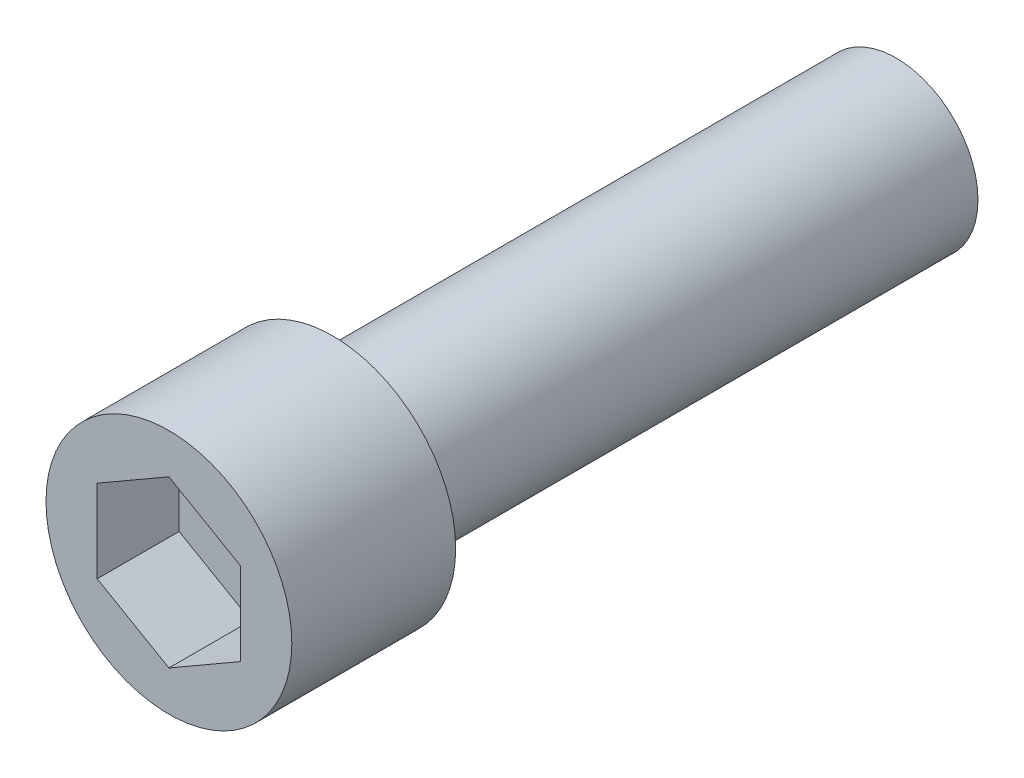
ISO-10303-21;
HEADER;
FILE_DESCRIPTION(('STEP AP214'),'2;1');
FILE_NAME('part.step','',(''),(''),'','','');
FILE_SCHEMA(('AUTOMOTIVE_DESIGN { 1 0 10303 214 1 1 1 1 }'));
ENDSEC;
DATA;
#1=APPLICATION_CONTEXT('core data for automotive mechanical design processes');
#2=APPLICATION_PROTOCOL_DEFINITION('international standard','automotive_design',2000,#1);
#3=PRODUCT_CONTEXT('',#1,'mechanical');
#4=PRODUCT('Part','Part','',(#3));
#5=PRODUCT_RELATED_PRODUCT_CATEGORY('part','',(#4));
#6=PRODUCT_DEFINITION_FORMATION('','',#4);
#7=PRODUCT_DEFINITION_CONTEXT('part definition',#1,'design');
#8=PRODUCT_DEFINITION('design','',#6,#7);
#9=PRODUCT_DEFINITION_SHAPE('','',#8);
#10=(LENGTH_UNIT() NAMED_UNIT(*) SI_UNIT(.MILLI.,.METRE.));
#11=(NAMED_UNIT(*) PLANE_ANGLE_UNIT() SI_UNIT($,.RADIAN.));
#12=(NAMED_UNIT(*) SI_UNIT($,.STERADIAN.) SOLID_ANGLE_UNIT());
#13=UNCERTAINTY_MEASURE_WITH_UNIT(LENGTH_MEASURE(1.E-05),#10,'distance_accuracy_value','');
#14=(GEOMETRIC_REPRESENTATION_CONTEXT(3) GLOBAL_UNCERTAINTY_ASSIGNED_CONTEXT((#13)) GLOBAL_UNIT_ASSIGNED_CONTEXT((#10,
#11,#12)) REPRESENTATION_CONTEXT('',''));
#15=CARTESIAN_POINT('',(0.,0.,0.));
#16=DIRECTION('',(0.,0.,1.));
#17=DIRECTION('',(1.,0.,0.));
#18=AXIS2_PLACEMENT_3D('',#15,#16,#17);
#19=CARTESIAN_POINT('',(0.,8.08290376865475,8.));
#20=DIRECTION('',(-0.5,-0.86602540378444,0.));
#21=DIRECTION('',(0.86602540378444,-0.5,0.));
#22=AXIS2_PLACEMENT_3D('',#19,#20,#21);
#23=PLANE('',#22);
#24=DIRECTION('',(0.,0.,1.));
#25=VECTOR('',#24,1.);
#26=CARTESIAN_POINT('',(7.,4.04145188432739,8.));
#27=LINE('',#26,#25);
#28=CARTESIAN_POINT('',(7.,4.04145188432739,8.));
#29=VERTEX_POINT('',#28);
#30=CARTESIAN_POINT('',(7.,4.04145188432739,16.));
#31=VERTEX_POINT('',#30);
#32=EDGE_CURVE('E64',#29,#31,#27,.T.);
#33=ORIENTED_EDGE('',*,*,#32,.T.);
#34=DIRECTION('',(0.86602540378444,-0.5,0.));
#35=VECTOR('',#34,1.);
#36=CARTESIAN_POINT('',(0.,8.08290376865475,16.));
#37=LINE('',#36,#35);
#38=CARTESIAN_POINT('',(0.,8.08290376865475,16.));
#39=VERTEX_POINT('',#38);
#40=EDGE_CURVE('E30',#39,#31,#37,.T.);
#41=ORIENTED_EDGE('',*,*,#40,.F.);
#42=DIRECTION('',(0.,0.,1.));
#43=VECTOR('',#42,1.);
#44=CARTESIAN_POINT('',(0.,8.08290376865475,8.));
#45=LINE('',#44,#43);
#46=CARTESIAN_POINT('',(0.,8.08290376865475,8.));
#47=VERTEX_POINT('',#46);
#48=EDGE_CURVE('E34',#47,#39,#45,.T.);
#49=ORIENTED_EDGE('',*,*,#48,.F.);
#50=DIRECTION('',(0.86602540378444,-0.5,0.));
#51=VECTOR('',#50,1.);
#52=CARTESIAN_POINT('',(0.,8.08290376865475,8.));
#53=LINE('',#52,#51);
#54=EDGE_CURVE('E66',#47,#29,#53,.T.);
#55=ORIENTED_EDGE('',*,*,#54,.T.);
#56=EDGE_LOOP('',(#33,#41,#49,#55));
#57=FACE_BOUND('',#56,.T.);
#58=ADVANCED_FACE('F15',(#57),#23,.T.);
#59=CARTESIAN_POINT('',(7.,-4.04145188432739,8.));
#60=DIRECTION('',(1.,0.,0.));
#61=DIRECTION('',(0.,1.,0.));
#62=AXIS2_PLACEMENT_3D('',#59,#60,#61);
#63=PLANE('',#62);
#64=DIRECTION('',(0.,0.,1.));
#65=VECTOR('',#64,1.);
#66=CARTESIAN_POINT('',(7.,-4.04145188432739,8.));
#67=LINE('',#66,#65);
#68=CARTESIAN_POINT('',(7.,-4.04145188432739,8.));
#69=VERTEX_POINT('',#68);
#70=CARTESIAN_POINT('',(7.,-4.04145188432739,16.));
#71=VERTEX_POINT('',#70);
#72=EDGE_CURVE('E71',#69,#71,#67,.T.);
#73=ORIENTED_EDGE('',*,*,#72,.T.);
#74=DIRECTION('',(0.,1.,0.));
#75=VECTOR('',#74,1.);
#76=CARTESIAN_POINT('',(7.,-4.04145188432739,16.));
#77=LINE('',#76,#75);
#78=EDGE_CURVE('E74',#71,#31,#77,.T.);
#79=ORIENTED_EDGE('',*,*,#78,.T.);
#80=ORIENTED_EDGE('',*,*,#32,.F.);
#81=DIRECTION('',(0.,1.,0.));
#82=VECTOR('',#81,1.);
#83=CARTESIAN_POINT('',(7.,-4.04145188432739,8.));
#84=LINE('',#83,#82);
#85=EDGE_CURVE('E100',#69,#29,#84,.T.);
#86=ORIENTED_EDGE('',*,*,#85,.F.);
#87=EDGE_LOOP('',(#73,#79,#80,#86));
#88=FACE_BOUND('',#87,.T.);
#89=ADVANCED_FACE('F75',(#88),#63,.F.);
#90=CARTESIAN_POINT('',(0.,-8.08290376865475,8.));
#91=DIRECTION('',(0.5,-0.86602540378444,0.));
#92=DIRECTION('',(0.86602540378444,0.5,0.));
#93=AXIS2_PLACEMENT_3D('',#90,#91,#92);
#94=PLANE('',#93);
#95=DIRECTION('',(0.,0.,1.));
#96=VECTOR('',#95,1.);
#97=CARTESIAN_POINT('',(0.,-8.08290376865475,8.));
#98=LINE('',#97,#96);
#99=CARTESIAN_POINT('',(0.,-8.08290376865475,8.));
#100=VERTEX_POINT('',#99);
#101=CARTESIAN_POINT('',(0.,-8.08290376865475,16.));
#102=VERTEX_POINT('',#101);
#103=EDGE_CURVE('E108',#100,#102,#98,.T.);
#104=ORIENTED_EDGE('',*,*,#103,.T.);
#105=DIRECTION('',(0.86602540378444,0.5,0.));
#106=VECTOR('',#105,1.);
#107=CARTESIAN_POINT('',(0.,-8.08290376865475,16.));
#108=LINE('',#107,#106);
#109=EDGE_CURVE('E79',#102,#71,#108,.T.);
#110=ORIENTED_EDGE('',*,*,#109,.T.);
#111=ORIENTED_EDGE('',*,*,#72,.F.);
#112=DIRECTION('',(0.86602540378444,0.5,0.));
#113=VECTOR('',#112,1.);
#114=CARTESIAN_POINT('',(0.,-8.08290376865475,8.));
#115=LINE('',#114,#113);
#116=EDGE_CURVE('E97',#100,#69,#115,.T.);
#117=ORIENTED_EDGE('',*,*,#116,.F.);
#118=EDGE_LOOP('',(#104,#110,#111,#117));
#119=FACE_BOUND('',#118,.T.);
#120=ADVANCED_FACE('F141',(#119),#94,.F.);
#121=CARTESIAN_POINT('',(0.,-8.08290376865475,8.));
#122=DIRECTION('',(0.5,0.86602540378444,0.));
#123=DIRECTION('',(-0.86602540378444,0.5,0.));
#124=AXIS2_PLACEMENT_3D('',#121,#122,#123);
#125=PLANE('',#124);
#126=DIRECTION('',(0.,0.,1.));
#127=VECTOR('',#126,1.);
#128=CARTESIAN_POINT('',(-7.,-4.04145188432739,8.));
#129=LINE('',#128,#127);
#130=CARTESIAN_POINT('',(-7.,-4.04145188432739,8.));
#131=VERTEX_POINT('',#130);
#132=CARTESIAN_POINT('',(-7.,-4.04145188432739,16.));
#133=VERTEX_POINT('',#132);
#134=EDGE_CURVE('E106',#131,#133,#129,.T.);
#135=ORIENTED_EDGE('',*,*,#134,.T.);
#136=DIRECTION('',(-0.86602540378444,0.5,0.));
#137=VECTOR('',#136,1.);
#138=CARTESIAN_POINT('',(0.,-8.08290376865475,16.));
#139=LINE('',#138,#137);
#140=EDGE_CURVE('E249',#102,#133,#139,.T.);
#141=ORIENTED_EDGE('',*,*,#140,.F.);
#142=ORIENTED_EDGE('',*,*,#103,.F.);
#143=DIRECTION('',(-0.86602540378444,0.5,0.));
#144=VECTOR('',#143,1.);
#145=CARTESIAN_POINT('',(0.,-8.08290376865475,8.));
#146=LINE('',#145,#144);
#147=EDGE_CURVE('E94',#100,#131,#146,.T.);
#148=ORIENTED_EDGE('',*,*,#147,.T.);
#149=EDGE_LOOP('',(#135,#141,#142,#148));
#150=FACE_BOUND('',#149,.T.);
#151=ADVANCED_FACE('F153',(#150),#125,.T.);
#152=CARTESIAN_POINT('',(-7.,4.04145188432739,8.));
#153=DIRECTION('',(-1.,0.,0.));
#154=DIRECTION('',(0.,-1.,0.));
#155=AXIS2_PLACEMENT_3D('',#152,#153,#154);
#156=PLANE('',#155);
#157=DIRECTION('',(0.,0.,1.));
#158=VECTOR('',#157,1.);
#159=CARTESIAN_POINT('',(-7.,4.04145188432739,8.));
#160=LINE('',#159,#158);
#161=CARTESIAN_POINT('',(-7.,4.04145188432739,8.));
#162=VERTEX_POINT('',#161);
#163=CARTESIAN_POINT('',(-7.,4.04145188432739,16.));
#164=VERTEX_POINT('',#163);
#165=EDGE_CURVE('E104',#162,#164,#160,.T.);
#166=ORIENTED_EDGE('',*,*,#165,.T.);
#167=DIRECTION('',(0.,-1.,0.));
#168=VECTOR('',#167,1.);
#169=CARTESIAN_POINT('',(-7.,4.04145188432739,16.));
#170=LINE('',#169,#168);
#171=EDGE_CURVE('E250',#164,#133,#170,.T.);
#172=ORIENTED_EDGE('',*,*,#171,.T.);
#173=ORIENTED_EDGE('',*,*,#134,.F.);
#174=DIRECTION('',(0.,-1.,0.));
#175=VECTOR('',#174,1.);
#176=CARTESIAN_POINT('',(-7.,4.04145188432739,8.));
#177=LINE('',#176,#175);
#178=EDGE_CURVE('E91',#162,#131,#177,.T.);
#179=ORIENTED_EDGE('',*,*,#178,.F.);
#180=EDGE_LOOP('',(#166,#172,#173,#179));
#181=FACE_BOUND('',#180,.T.);
#182=ADVANCED_FACE('F149',(#181),#156,.F.);
#183=CARTESIAN_POINT('',(0.,8.08290376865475,8.));
#184=DIRECTION('',(-0.5,0.86602540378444,0.));
#185=DIRECTION('',(-0.86602540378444,-0.5,0.));
#186=AXIS2_PLACEMENT_3D('',#183,#184,#185);
#187=PLANE('',#186);
#188=DIRECTION('',(-0.86602540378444,-0.5,0.));
#189=VECTOR('',#188,1.);
#190=CARTESIAN_POINT('',(0.,8.08290376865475,8.));
#191=LINE('',#190,#189);
#192=EDGE_CURVE('E88',#47,#162,#191,.T.);
#193=ORIENTED_EDGE('',*,*,#192,.F.);
#194=ORIENTED_EDGE('',*,*,#48,.T.);
#195=DIRECTION('',(-0.86602540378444,-0.5,0.));
#196=VECTOR('',#195,1.);
#197=CARTESIAN_POINT('',(0.,8.08290376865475,16.));
#198=LINE('',#197,#196);
#199=EDGE_CURVE('E84',#39,#164,#198,.T.);
#200=ORIENTED_EDGE('',*,*,#199,.T.);
#201=ORIENTED_EDGE('',*,*,#165,.F.);
#202=EDGE_LOOP('',(#193,#194,#200,#201));
#203=FACE_BOUND('',#202,.T.);
#204=ADVANCED_FACE('F146',(#203),#187,.F.);
#205=CARTESIAN_POINT('',(-7.,12.1243556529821,8.));
#206=DIRECTION('',(0.,0.,-1.));
#207=DIRECTION('',(-1.,0.,0.));
#208=AXIS2_PLACEMENT_3D('',#205,#206,#207);
#209=PLANE('',#208);
#210=ORIENTED_EDGE('',*,*,#54,.F.);
#211=ORIENTED_EDGE('',*,*,#192,.T.);
#212=ORIENTED_EDGE('',*,*,#178,.T.);
#213=ORIENTED_EDGE('',*,*,#147,.F.);
#214=ORIENTED_EDGE('',*,*,#116,.T.);
#215=ORIENTED_EDGE('',*,*,#85,.T.);
#216=EDGE_LOOP('',(#210,#211,#212,#213,#214,#215));
#217=FACE_BOUND('',#216,.T.);
#218=ADVANCED_FACE('F145',(#217),#209,.F.);
#219=CARTESIAN_POINT('',(0.,0.,16.));
#220=DIRECTION('',(0.,0.,1.));
#221=DIRECTION('',(1.,0.,0.));
#222=AXIS2_PLACEMENT_3D('',#219,#220,#221);
#223=PLANE('',#222);
#224=CARTESIAN_POINT('',(0.,0.,16.));
#225=DIRECTION('',(0.,0.,1.));
#226=DIRECTION('',(1.,0.,0.));
#227=AXIS2_PLACEMENT_3D('',#224,#225,#226);
#228=CIRCLE('',#227,12.);
#229=CARTESIAN_POINT('',(12.,0.,16.));
#230=VERTEX_POINT('',#229);
#231=EDGE_CURVE('E9',#230,#230,#228,.T.);
#232=ORIENTED_EDGE('',*,*,#231,.T.);
#233=EDGE_LOOP('',(#232));
#234=FACE_BOUND('',#233,.T.);
#235=ORIENTED_EDGE('',*,*,#199,.F.);
#236=ORIENTED_EDGE('',*,*,#40,.T.);
#237=ORIENTED_EDGE('',*,*,#78,.F.);
#238=ORIENTED_EDGE('',*,*,#109,.F.);
#239=ORIENTED_EDGE('',*,*,#140,.T.);
#240=ORIENTED_EDGE('',*,*,#171,.F.);
#241=EDGE_LOOP('',(#235,#236,#237,#238,#239,#240));
#242=FACE_BOUND('',#241,.T.);
#243=ADVANCED_FACE('F17',(#234,#242),#223,.T.);
#244=CARTESIAN_POINT('',(0.,0.,-35.));
#245=DIRECTION('',(0.,0.,1.));
#246=DIRECTION('',(1.,0.,0.));
#247=AXIS2_PLACEMENT_3D('',#244,#245,#246);
#248=CYLINDRICAL_SURFACE('',#247,12.);
#249=CARTESIAN_POINT('',(0.,0.,0.));
#250=DIRECTION('',(0.,0.,1.));
#251=DIRECTION('',(1.,0.,0.));
#252=AXIS2_PLACEMENT_3D('',#249,#250,#251);
#253=CIRCLE('',#252,12.);
#254=CARTESIAN_POINT('',(12.,0.,0.));
#255=VERTEX_POINT('',#254);
#256=EDGE_CURVE('E23',#255,#255,#253,.T.);
#257=ORIENTED_EDGE('',*,*,#256,.T.);
#258=EDGE_LOOP('',(#257));
#259=FACE_BOUND('',#258,.T.);
#260=ORIENTED_EDGE('',*,*,#231,.F.);
#261=EDGE_LOOP('',(#260));
#262=FACE_BOUND('',#261,.T.);
#263=ADVANCED_FACE('F118',(#259,#262),#248,.T.);
#264=CARTESIAN_POINT('',(12.,0.,0.));
#265=DIRECTION('',(0.,0.,-1.));
#266=DIRECTION('',(-1.,0.,0.));
#267=AXIS2_PLACEMENT_3D('',#264,#265,#266);
#268=PLANE('',#267);
#269=CARTESIAN_POINT('',(0.,0.,0.));
#270=DIRECTION('',(0.,0.,1.));
#271=DIRECTION('',(1.,0.,0.));
#272=AXIS2_PLACEMENT_3D('',#269,#270,#271);
#273=CIRCLE('',#272,8.);
#274=CARTESIAN_POINT('',(8.,0.,0.));
#275=VERTEX_POINT('',#274);
#276=EDGE_CURVE('E113',#275,#275,#273,.T.);
#277=ORIENTED_EDGE('',*,*,#276,.T.);
#278=EDGE_LOOP('',(#277));
#279=FACE_BOUND('',#278,.T.);
#280=ORIENTED_EDGE('',*,*,#256,.F.);
#281=EDGE_LOOP('',(#280));
#282=FACE_BOUND('',#281,.T.);
#283=ADVANCED_FACE('F121',(#279,#282),#268,.T.);
#284=CARTESIAN_POINT('',(0.,0.,-35.));
#285=DIRECTION('',(0.,0.,1.));
#286=DIRECTION('',(1.,0.,0.));
#287=AXIS2_PLACEMENT_3D('',#284,#285,#286);
#288=CYLINDRICAL_SURFACE('',#287,8.);
#289=CARTESIAN_POINT('',(0.,0.,-55.));
#290=DIRECTION('',(0.,0.,1.));
#291=DIRECTION('',(1.,0.,0.));
#292=AXIS2_PLACEMENT_3D('',#289,#290,#291);
#293=CIRCLE('',#292,8.);
#294=CARTESIAN_POINT('',(8.,0.,-55.));
#295=VERTEX_POINT('',#294);
#296=EDGE_CURVE('E70',#295,#295,#293,.T.);
#297=ORIENTED_EDGE('',*,*,#296,.T.);
#298=EDGE_LOOP('',(#297));
#299=FACE_BOUND('',#298,.T.);
#300=ORIENTED_EDGE('',*,*,#276,.F.);
#301=EDGE_LOOP('',(#300));
#302=FACE_BOUND('',#301,.T.);
#303=ADVANCED_FACE('F123',(#299,#302),#288,.T.);
#304=CARTESIAN_POINT('',(8.,0.,-55.));
#305=DIRECTION('',(0.,0.,-1.));
#306=DIRECTION('',(-1.,0.,0.));
#307=AXIS2_PLACEMENT_3D('',#304,#305,#306);
#308=PLANE('',#307);
#309=ORIENTED_EDGE('',*,*,#296,.F.);
#310=EDGE_LOOP('',(#309));
#311=FACE_BOUND('',#310,.T.);
#312=ADVANCED_FACE('F132',(#311),#308,.T.);
#313=CLOSED_SHELL('',(#58,#89,#120,#151,#182,#204,#218,#243,#263,#283,#303,#312));
#314=MANIFOLD_SOLID_BREP('B1',#313);
#315=ADVANCED_BREP_SHAPE_REPRESENTATION('',(#18,#314),#14);
#316=SHAPE_DEFINITION_REPRESENTATION(#9,#315);
ENDSEC;
END-ISO-10303-21;
